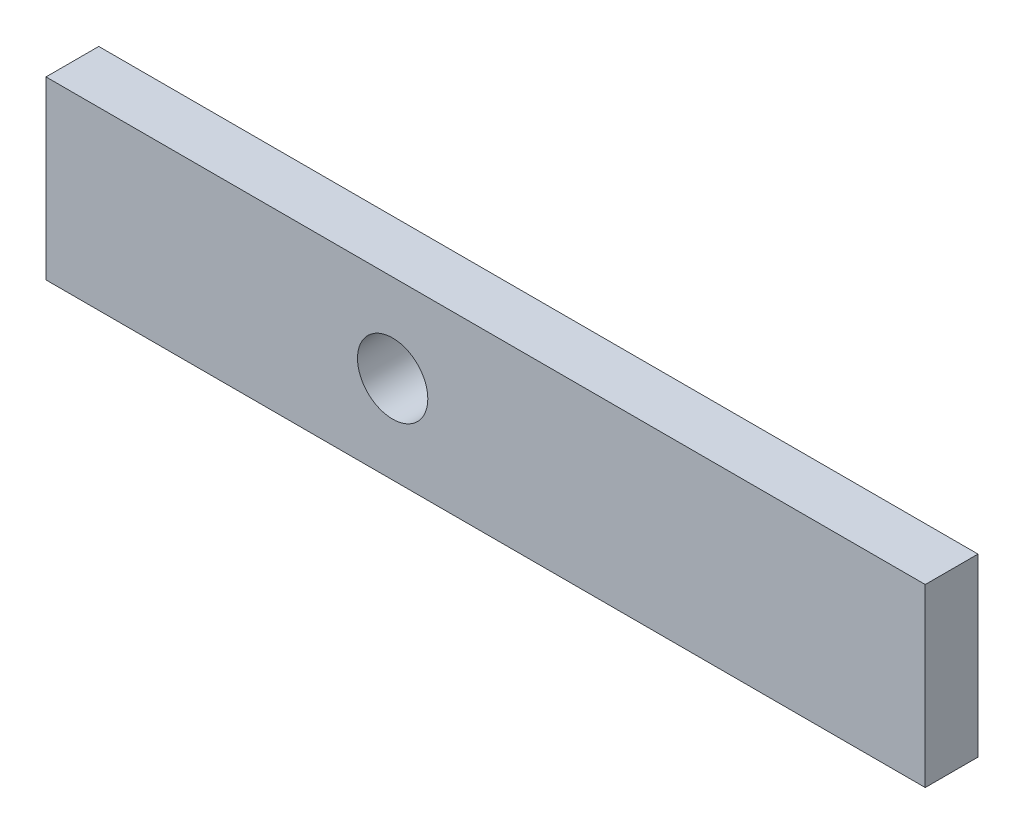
from build123d import *

# Parameters (mm, degrees)
ESQUISSE1_W             = 100
ESQUISSE1_H             = 20
BASE_EXTRUSION_DEPTH    = 6
ESQUISSE2_R             = 4
ENL_V_MAT_EXTRU_1_DEPTH = 103.156742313


with BuildPart() as part:
    # Esquisse1 → Base-Extrusion (new body)
    with BuildSketch(Plane.XY):
        with Locations((50, 10)):
            Rectangle(ESQUISSE1_W, ESQUISSE1_H)
    extrude(amount=BASE_EXTRUSION_DEPTH)

    # Esquisse2 → Enl_v. mat.-Extru.1 (cut, through all)
    with BuildSketch(Plane.XY.offset(6)):
        with Locations((39.42628253, 10)):
            Circle(ESQUISSE2_R)
    extrude(amount=-ENL_V_MAT_EXTRU_1_DEPTH, mode=Mode.SUBTRACT)


solid = part.part
